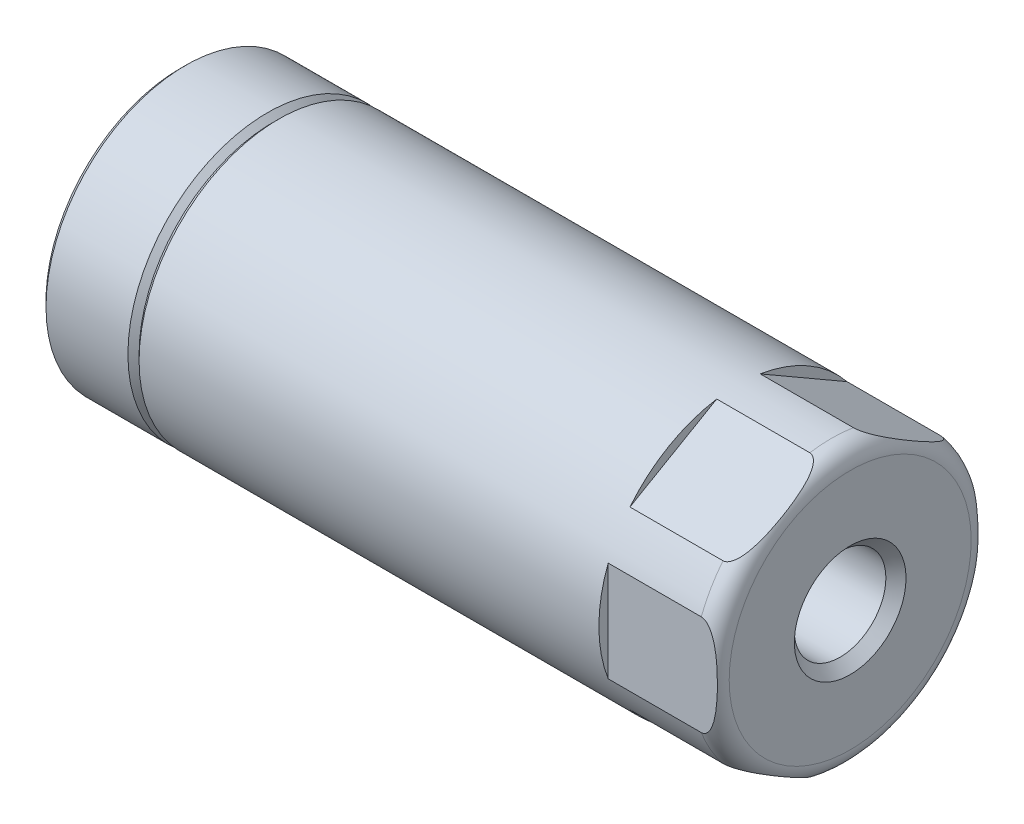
ISO-10303-21;
HEADER;
FILE_DESCRIPTION(('STEP AP214'),'2;1');
FILE_NAME('part.step','',(''),(''),'','','');
FILE_SCHEMA(('AUTOMOTIVE_DESIGN { 1 0 10303 214 1 1 1 1 }'));
ENDSEC;
DATA;
#1=APPLICATION_CONTEXT('core data for automotive mechanical design processes');
#2=APPLICATION_PROTOCOL_DEFINITION('international standard','automotive_design',2000,#1);
#3=PRODUCT_CONTEXT('',#1,'mechanical');
#4=PRODUCT('Part','Part','',(#3));
#5=PRODUCT_RELATED_PRODUCT_CATEGORY('part','',(#4));
#6=PRODUCT_DEFINITION_FORMATION('','',#4);
#7=PRODUCT_DEFINITION_CONTEXT('part definition',#1,'design');
#8=PRODUCT_DEFINITION('design','',#6,#7);
#9=PRODUCT_DEFINITION_SHAPE('','',#8);
#10=(LENGTH_UNIT() NAMED_UNIT(*) SI_UNIT(.MILLI.,.METRE.));
#11=(NAMED_UNIT(*) PLANE_ANGLE_UNIT() SI_UNIT($,.RADIAN.));
#12=(NAMED_UNIT(*) SI_UNIT($,.STERADIAN.) SOLID_ANGLE_UNIT());
#13=UNCERTAINTY_MEASURE_WITH_UNIT(LENGTH_MEASURE(1.E-05),#10,'distance_accuracy_value','');
#14=(GEOMETRIC_REPRESENTATION_CONTEXT(3) GLOBAL_UNCERTAINTY_ASSIGNED_CONTEXT((#13)) GLOBAL_UNIT_ASSIGNED_CONTEXT((#10,
#11,#12)) REPRESENTATION_CONTEXT('',''));
#15=CARTESIAN_POINT('',(0.,0.,0.));
#16=DIRECTION('',(0.,0.,1.));
#17=DIRECTION('',(1.,0.,0.));
#18=AXIS2_PLACEMENT_3D('',#15,#16,#17);
#19=CARTESIAN_POINT('',(210.,0.,0.));
#20=DIRECTION('',(-1.,0.,0.));
#21=DIRECTION('',(0.,0.,1.));
#22=AXIS2_PLACEMENT_3D('',#19,#20,#21);
#23=CYLINDRICAL_SURFACE('',#22,4.25);
#24=CARTESIAN_POINT('',(174.,0.,0.));
#25=DIRECTION('',(-1.,0.,0.));
#26=DIRECTION('',(0.,0.,1.));
#27=AXIS2_PLACEMENT_3D('',#24,#25,#26);
#28=CIRCLE('',#27,4.25);
#29=CARTESIAN_POINT('',(174.,0.,4.25));
#30=VERTEX_POINT('',#29);
#31=EDGE_CURVE('E163',#30,#30,#28,.T.);
#32=ORIENTED_EDGE('',*,*,#31,.T.);
#33=EDGE_LOOP('',(#32));
#34=FACE_BOUND('',#33,.T.);
#35=CARTESIAN_POINT('',(198.199999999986,0.,0.));
#36=DIRECTION('',(-1.,0.,0.));
#37=DIRECTION('',(0.,0.,1.));
#38=AXIS2_PLACEMENT_3D('',#35,#36,#37);
#39=CIRCLE('',#38,4.25000000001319);
#40=CARTESIAN_POINT('',(198.199999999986,0.,4.25000000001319));
#41=VERTEX_POINT('',#40);
#42=EDGE_CURVE('E160',#41,#41,#39,.F.);
#43=ORIENTED_EDGE('',*,*,#42,.T.);
#44=EDGE_LOOP('',(#43));
#45=FACE_BOUND('',#44,.T.);
#46=ADVANCED_FACE('F17',(#34,#45),#23,.F.);
#47=CARTESIAN_POINT('',(174.,0.,0.));
#48=DIRECTION('',(1.,0.,0.));
#49=DIRECTION('',(0.,0.,-1.));
#50=AXIS2_PLACEMENT_3D('',#47,#48,#49);
#51=PLANE('',#50);
#52=ORIENTED_EDGE('',*,*,#31,.F.);
#53=EDGE_LOOP('',(#52));
#54=FACE_BOUND('',#53,.T.);
#55=CARTESIAN_POINT('',(174.,0.,0.));
#56=DIRECTION('',(1.,0.,0.));
#57=DIRECTION('',(0.,0.,-1.));
#58=AXIS2_PLACEMENT_3D('',#55,#56,#57);
#59=CIRCLE('',#58,7.20000000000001);
#60=CARTESIAN_POINT('',(174.,0.,-7.20000000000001));
#61=VERTEX_POINT('',#60);
#62=EDGE_CURVE('E159',#61,#61,#59,.T.);
#63=ORIENTED_EDGE('',*,*,#62,.F.);
#64=EDGE_LOOP('',(#63));
#65=FACE_BOUND('',#64,.T.);
#66=ADVANCED_FACE('F507',(#54,#65),#51,.F.);
#67=CARTESIAN_POINT('',(198.199999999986,0.,0.));
#68=DIRECTION('',(-1.,0.,0.));
#69=DIRECTION('',(0.,0.,1.));
#70=AXIS2_PLACEMENT_3D('',#67,#68,#69);
#71=CONICAL_SURFACE('',#70,4.25000000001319,1.04719755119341);
#72=ORIENTED_EDGE('',*,*,#42,.F.);
#73=EDGE_LOOP('',(#72));
#74=FACE_BOUND('',#73,.T.);
#75=CARTESIAN_POINT('',(199.234323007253,0.,0.));
#76=DIRECTION('',(-1.,0.,0.));
#77=DIRECTION('',(0.,0.,1.));
#78=AXIS2_PLACEMENT_3D('',#75,#76,#77);
#79=CIRCLE('',#78,2.4585);
#80=CARTESIAN_POINT('',(199.234323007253,0.,2.4585));
#81=VERTEX_POINT('',#80);
#82=EDGE_CURVE('E156',#81,#81,#79,.F.);
#83=ORIENTED_EDGE('',*,*,#82,.T.);
#84=EDGE_LOOP('',(#83));
#85=FACE_BOUND('',#84,.T.);
#86=ADVANCED_FACE('F497',(#74,#85),#71,.F.);
#87=CARTESIAN_POINT('',(174.3,0.,0.));
#88=DIRECTION('',(1.,0.,0.));
#89=DIRECTION('',(0.,0.,-1.));
#90=AXIS2_PLACEMENT_3D('',#87,#88,#89);
#91=CONICAL_SURFACE('',#90,7.5,0.785398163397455);
#92=CARTESIAN_POINT('',(174.3,0.,0.));
#93=DIRECTION('',(-1.,0.,0.));
#94=DIRECTION('',(0.,0.,1.));
#95=AXIS2_PLACEMENT_3D('',#92,#93,#94);
#96=CIRCLE('',#95,7.5);
#97=CARTESIAN_POINT('',(174.3,0.,7.5));
#98=VERTEX_POINT('',#97);
#99=EDGE_CURVE('E153',#98,#98,#96,.F.);
#100=ORIENTED_EDGE('',*,*,#99,.F.);
#101=EDGE_LOOP('',(#100));
#102=FACE_BOUND('',#101,.T.);
#103=ORIENTED_EDGE('',*,*,#62,.T.);
#104=EDGE_LOOP('',(#103));
#105=FACE_BOUND('',#104,.T.);
#106=ADVANCED_FACE('F487',(#102,#105),#91,.T.);
#107=CARTESIAN_POINT('',(210.,0.,0.));
#108=DIRECTION('',(-1.,0.,0.));
#109=DIRECTION('',(0.,0.,1.));
#110=AXIS2_PLACEMENT_3D('',#107,#108,#109);
#111=CYLINDRICAL_SURFACE('',#110,2.4585);
#112=ORIENTED_EDGE('',*,*,#82,.F.);
#113=EDGE_LOOP('',(#112));
#114=FACE_BOUND('',#113,.T.);
#115=CARTESIAN_POINT('',(209.458499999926,0.,0.));
#116=DIRECTION('',(1.,0.,0.));
#117=DIRECTION('',(0.,0.,-1.));
#118=AXIS2_PLACEMENT_3D('',#115,#116,#117);
#119=CIRCLE('',#118,2.45849999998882);
#120=CARTESIAN_POINT('',(209.458499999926,0.,-2.45849999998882));
#121=VERTEX_POINT('',#120);
#122=EDGE_CURVE('E150',#121,#121,#119,.T.);
#123=ORIENTED_EDGE('',*,*,#122,.T.);
#124=EDGE_LOOP('',(#123));
#125=FACE_BOUND('',#124,.T.);
#126=ADVANCED_FACE('F476',(#114,#125),#111,.F.);
#127=CARTESIAN_POINT('',(210.,0.,0.));
#128=DIRECTION('',(-1.,0.,0.));
#129=DIRECTION('',(0.,0.,1.));
#130=AXIS2_PLACEMENT_3D('',#127,#128,#129);
#131=CYLINDRICAL_SURFACE('',#130,7.5);
#132=ORIENTED_EDGE('',*,*,#99,.T.);
#133=EDGE_LOOP('',(#132));
#134=FACE_BOUND('',#133,.T.);
#135=CARTESIAN_POINT('',(178.7,0.,0.));
#136=DIRECTION('',(-1.,0.,0.));
#137=DIRECTION('',(0.,0.,1.));
#138=AXIS2_PLACEMENT_3D('',#135,#136,#137);
#139=CIRCLE('',#138,7.5);
#140=CARTESIAN_POINT('',(178.7,0.,7.5));
#141=VERTEX_POINT('',#140);
#142=EDGE_CURVE('E140',#141,#141,#139,.F.);
#143=ORIENTED_EDGE('',*,*,#142,.F.);
#144=EDGE_LOOP('',(#143));
#145=FACE_BOUND('',#144,.T.);
#146=ADVANCED_FACE('F466',(#134,#145),#131,.T.);
#147=CARTESIAN_POINT('',(209.999999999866,0.,0.));
#148=DIRECTION('',(1.,0.,0.));
#149=DIRECTION('',(0.,0.,-1.));
#150=AXIS2_PLACEMENT_3D('',#147,#148,#149);
#151=CONICAL_SURFACE('',#150,2.99999999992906,0.785398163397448);
#152=CARTESIAN_POINT('',(209.999999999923,0.,0.));
#153=DIRECTION('',(1.,0.,0.));
#154=DIRECTION('',(0.,0.,-1.));
#155=AXIS2_PLACEMENT_3D('',#152,#153,#154);
#156=CIRCLE('',#155,2.9999999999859);
#157=CARTESIAN_POINT('',(209.999999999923,0.,-2.9999999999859));
#158=VERTEX_POINT('',#157);
#159=EDGE_CURVE('E130',#158,#158,#156,.T.);
#160=ORIENTED_EDGE('',*,*,#159,.T.);
#161=EDGE_LOOP('',(#160));
#162=FACE_BOUND('',#161,.T.);
#163=ORIENTED_EDGE('',*,*,#122,.F.);
#164=EDGE_LOOP('',(#163));
#165=FACE_BOUND('',#164,.T.);
#166=ADVANCED_FACE('F456',(#162,#165),#151,.F.);
#167=CARTESIAN_POINT('',(178.7,0.,0.));
#168=DIRECTION('',(-1.,0.,0.));
#169=DIRECTION('',(0.,0.,1.));
#170=AXIS2_PLACEMENT_3D('',#167,#168,#169);
#171=CONICAL_SURFACE('',#170,7.5,0.785398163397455);
#172=ORIENTED_EDGE('',*,*,#142,.T.);
#173=EDGE_LOOP('',(#172));
#174=FACE_BOUND('',#173,.T.);
#175=CARTESIAN_POINT('',(179.,0.,0.));
#176=DIRECTION('',(1.,0.,0.));
#177=DIRECTION('',(0.,0.,-1.));
#178=AXIS2_PLACEMENT_3D('',#175,#176,#177);
#179=CIRCLE('',#178,7.2);
#180=CARTESIAN_POINT('',(179.,0.,-7.2));
#181=VERTEX_POINT('',#180);
#182=EDGE_CURVE('E145',#181,#181,#179,.T.);
#183=ORIENTED_EDGE('',*,*,#182,.F.);
#184=EDGE_LOOP('',(#183));
#185=FACE_BOUND('',#184,.T.);
#186=ADVANCED_FACE('F446',(#174,#185),#171,.T.);
#187=CARTESIAN_POINT('',(204.,0.,0.));
#188=DIRECTION('',(1.,0.,0.));
#189=DIRECTION('',(0.,0.,-1.));
#190=AXIS2_PLACEMENT_3D('',#187,#188,#189);
#191=PLANE('',#190);
#192=CARTESIAN_POINT('',(204.,0.,0.));
#193=DIRECTION('',(-1.,0.,0.));
#194=DIRECTION('',(0.,0.,1.));
#195=AXIS2_PLACEMENT_3D('',#192,#193,#194);
#196=CIRCLE('',#195,7.5);
#197=CARTESIAN_POINT('',(204.,-4.71588662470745,-5.8318447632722));
#198=VERTEX_POINT('',#197);
#199=CARTESIAN_POINT('',(204.,-7.4084690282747,-1.16815523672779));
#200=VERTEX_POINT('',#199);
#201=EDGE_CURVE('E138',#198,#200,#196,.T.);
#202=ORIENTED_EDGE('',*,*,#201,.F.);
#203=DIRECTION('',(0.,0.5,-0.866025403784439));
#204=VECTOR('',#203,1.);
#205=CARTESIAN_POINT('',(204.,-8.08290376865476,0.));
#206=LINE('',#205,#204);
#207=EDGE_CURVE('E131',#200,#198,#206,.T.);
#208=ORIENTED_EDGE('',*,*,#207,.F.);
#209=EDGE_LOOP('',(#202,#208));
#210=FACE_BOUND('',#209,.T.);
#211=ADVANCED_FACE('F436',(#210),#191,.T.);
#212=CARTESIAN_POINT('',(204.,-8.08290376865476,0.));
#213=DIRECTION('',(0.,-0.866025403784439,-0.5));
#214=DIRECTION('',(0.,0.5,-0.866025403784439));
#215=AXIS2_PLACEMENT_3D('',#212,#213,#214);
#216=PLANE('',#215);
#217=DIRECTION('',(-1.,0.,0.));
#218=VECTOR('',#217,1.);
#219=CARTESIAN_POINT('',(210.,-4.71588662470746,-5.8318447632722));
#220=LINE('',#219,#218);
#221=CARTESIAN_POINT('',(209.,-4.71588662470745,-5.83184476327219));
#222=VERTEX_POINT('',#221);
#223=EDGE_CURVE('E141',#222,#198,#220,.T.);
#224=ORIENTED_EDGE('',*,*,#223,.F.);
#225=CARTESIAN_POINT('',(209.,-7.40846902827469,-1.16815523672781));
#226=CARTESIAN_POINT('',(209.011200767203,-7.40847068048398,-1.16815237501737));
#227=CARTESIAN_POINT('',(209.022395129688,-7.40820674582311,-1.16860952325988));
#228=CARTESIAN_POINT('',(209.044675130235,-7.40716421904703,-1.17041523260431));
#229=CARTESIAN_POINT('',(209.055760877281,-7.40638621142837,-1.17176278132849));
#230=CARTESIAN_POINT('',(209.088480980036,-7.40332998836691,-1.17705631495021));
#231=CARTESIAN_POINT('',(209.10985577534,-7.40032867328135,-1.18225474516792));
#232=CARTESIAN_POINT('',(209.155857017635,-7.39182550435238,-1.19698266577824));
#233=CARTESIAN_POINT('',(209.180179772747,-7.38592181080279,-1.20720816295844));
#234=CARTESIAN_POINT('',(209.226666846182,-7.37221448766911,-1.23094994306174));
#235=CARTESIAN_POINT('',(209.248820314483,-7.36440192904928,-1.24448169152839));
#236=CARTESIAN_POINT('',(209.30292151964,-7.34254059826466,-1.28234662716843));
#237=CARTESIAN_POINT('',(209.333218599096,-7.32748167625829,-1.30842944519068));
#238=CARTESIAN_POINT('',(209.38904214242,-7.29533035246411,-1.3641171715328));
#239=CARTESIAN_POINT('',(209.41455922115,-7.27823405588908,-1.39372882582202));
#240=CARTESIAN_POINT('',(209.46152941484,-7.24289259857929,-1.4549420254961));
#241=CARTESIAN_POINT('',(209.48300984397,-7.22465636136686,-1.48652811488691));
#242=CARTESIAN_POINT('',(209.522851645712,-7.18734173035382,-1.55115895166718));
#243=CARTESIAN_POINT('',(209.541209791,-7.16826249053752,-1.58420516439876));
#244=CARTESIAN_POINT('',(209.575375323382,-7.12949680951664,-1.65134929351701));
#245=CARTESIAN_POINT('',(209.591176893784,-7.10980910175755,-1.68544940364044));
#246=CARTESIAN_POINT('',(209.620594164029,-7.07004566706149,-1.75432169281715));
#247=CARTESIAN_POINT('',(209.634210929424,-7.049970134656,-1.78909353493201));
#248=CARTESIAN_POINT('',(209.675329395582,-6.98453529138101,-1.90243000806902));
#249=CARTESIAN_POINT('',(209.699183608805,-6.93860314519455,-1.98198681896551));
#250=CARTESIAN_POINT('',(209.740410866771,-6.84595991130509,-2.14244960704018));
#251=CARTESIAN_POINT('',(209.757770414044,-6.7992474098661,-2.22335803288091));
#252=CARTESIAN_POINT('',(209.787604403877,-6.70539133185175,-2.38592152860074));
#253=CARTESIAN_POINT('',(209.800073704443,-6.65824735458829,-2.46757729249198));
#254=CARTESIAN_POINT('',(209.821278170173,-6.56348745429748,-2.63170625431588));
#255=CARTESIAN_POINT('',(209.829991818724,-6.51587037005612,-2.71418146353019));
#256=CARTESIAN_POINT('',(209.844338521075,-6.42058538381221,-2.87921990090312));
#257=CARTESIAN_POINT('',(209.849975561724,-6.37291762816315,-2.96178287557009));
#258=CARTESIAN_POINT('',(209.858670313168,-6.27754207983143,-3.12697817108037));
#259=CARTESIAN_POINT('',(209.861728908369,-6.22983430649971,-3.20961045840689));
#260=CARTESIAN_POINT('',(209.86649177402,-6.11091781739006,-3.41557985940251));
#261=CARTESIAN_POINT('',(209.866789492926,-6.03969415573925,-3.53894286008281));
#262=CARTESIAN_POINT('',(209.862355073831,-5.89724505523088,-3.78567193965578));
#263=CARTESIAN_POINT('',(209.857619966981,-5.82601964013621,-3.90903797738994));
#264=CARTESIAN_POINT('',(209.842243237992,-5.68414906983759,-4.15476501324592));
#265=CARTESIAN_POINT('',(209.831638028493,-5.61350303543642,-4.277127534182));
#266=CARTESIAN_POINT('',(209.809751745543,-5.5078668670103,-4.46009474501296));
#267=CARTESIAN_POINT('',(209.801463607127,-5.47272177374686,-4.52096783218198));
#268=CARTESIAN_POINT('',(209.782472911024,-5.40259597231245,-4.64242928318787));
#269=CARTESIAN_POINT('',(209.771770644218,-5.36761524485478,-4.70301768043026));
#270=CARTESIAN_POINT('',(209.746614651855,-5.29561289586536,-4.82772940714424));
#271=CARTESIAN_POINT('',(209.731960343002,-5.25860851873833,-4.89182286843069));
#272=CARTESIAN_POINT('',(209.698358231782,-5.18495954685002,-5.01938662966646));
#273=CARTESIAN_POINT('',(209.679398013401,-5.14831631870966,-5.08285456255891));
#274=CARTESIAN_POINT('',(209.645016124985,-5.09103788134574,-5.18206372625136));
#275=CARTESIAN_POINT('',(209.631438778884,-5.07012641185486,-5.21828345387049));
#276=CARTESIAN_POINT('',(209.60204878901,-5.02870248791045,-5.29003179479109));
#277=CARTESIAN_POINT('',(209.586236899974,-5.00818990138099,-5.32556063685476));
#278=CARTESIAN_POINT('',(209.552001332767,-4.96781298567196,-5.39549550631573));
#279=CARTESIAN_POINT('',(209.533588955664,-4.94794628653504,-5.42990563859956));
#280=CARTESIAN_POINT('',(209.493517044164,-4.90902856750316,-5.49731310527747));
#281=CARTESIAN_POINT('',(209.47185725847,-4.88997761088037,-5.53031033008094));
#282=CARTESIAN_POINT('',(209.430202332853,-4.85755467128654,-5.58646850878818));
#283=CARTESIAN_POINT('',(209.411049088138,-4.84391461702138,-5.61009377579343));
#284=CARTESIAN_POINT('',(209.370040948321,-4.81770589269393,-5.65548861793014));
#285=CARTESIAN_POINT('',(209.348190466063,-4.80513552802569,-5.6772611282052));
#286=CARTESIAN_POINT('',(209.301015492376,-4.78136907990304,-5.71842582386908));
#287=CARTESIAN_POINT('',(209.275647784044,-4.7701940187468,-5.73778159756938));
#288=CARTESIAN_POINT('',(209.221370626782,-4.7502362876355,-5.77234940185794));
#289=CARTESIAN_POINT('',(209.19247291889,-4.74144598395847,-5.78757465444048));
#290=CARTESIAN_POINT('',(209.142228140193,-4.72981901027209,-5.80771316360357));
#291=CARTESIAN_POINT('',(209.121814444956,-4.72597601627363,-5.81436942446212));
#292=CARTESIAN_POINT('',(209.080005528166,-4.72004816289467,-5.8246367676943));
#293=CARTESIAN_POINT('',(209.0586131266,-4.71795855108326,-5.82825608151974));
#294=CARTESIAN_POINT('',(209.030893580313,-4.71652468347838,-5.83073961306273));
#295=CARTESIAN_POINT('',(209.024723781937,-4.71628564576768,-5.83115363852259));
#296=CARTESIAN_POINT('',(209.012370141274,-4.71596676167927,-5.83170596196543));
#297=CARTESIAN_POINT('',(209.006186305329,-4.71588685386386,-5.83184436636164));
#298=CARTESIAN_POINT('',(209.,-4.71588662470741,-5.83184476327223));
#299=B_SPLINE_CURVE_WITH_KNOTS('',3,(#225,#226,#227,#228,#229,#230,#231,#232,#233,#234,#235,
#236,#237,#238,#239,#240,#241,#242,#243,#244,#245,#246,#247,#248,#249,#250,#251,#252,#253,#254,
#255,#256,#257,#258,#259,#260,#261,#262,#263,#264,#265,#266,#267,#268,#269,#270,#271,#272,#273,
#274,#275,#276,#277,#278,#279,#280,#281,#282,#283,#284,#285,#286,#287,#288,#289,#290,#291,#292,
#293,#294,#295,#296,#297,#298),.UNSPECIFIED.,.F.,.F.,(4,2,2,2,2,2,2,2,2,2,2,2,2,2,2,2,2,2,2,2,2,
2,2,2,2,2,2,2,2,2,2,2,2,2,2,2,4),(0.,0.0335780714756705,0.0671180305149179,0.133377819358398,
0.214046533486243,0.295100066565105,0.42254080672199,0.550229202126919,0.677019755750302,
0.8039405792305,0.931146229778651,1.0582896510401,1.34262726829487,1.627552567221,
1.9127766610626,2.19961379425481,2.48607833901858,2.77244458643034,3.19969305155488,
3.62719368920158,4.05207175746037,4.26437145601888,4.47664558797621,4.70289408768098,
4.92980344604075,5.06166900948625,5.19349014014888,5.32475509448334,5.45603021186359,
5.55589257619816,5.65559367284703,5.75665111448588,5.85738114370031,5.92257044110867,
5.98758247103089,6.00614159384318,6.02469354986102),.UNSPECIFIED.);
#300=CARTESIAN_POINT('',(209.,-7.40846902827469,-1.1681552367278));
#301=VERTEX_POINT('',#300);
#302=EDGE_CURVE('E106',#301,#222,#299,.T.);
#303=ORIENTED_EDGE('',*,*,#302,.F.);
#304=DIRECTION('',(-1.,0.,0.));
#305=VECTOR('',#304,1.);
#306=CARTESIAN_POINT('',(210.,-7.4084690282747,-1.16815523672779));
#307=LINE('',#306,#305);
#308=EDGE_CURVE('E135',#200,#301,#307,.F.);
#309=ORIENTED_EDGE('',*,*,#308,.F.);
#310=ORIENTED_EDGE('',*,*,#207,.T.);
#311=EDGE_LOOP('',(#224,#303,#309,#310));
#312=FACE_BOUND('',#311,.T.);
#313=ADVANCED_FACE('F426',(#312),#216,.T.);
#314=CARTESIAN_POINT('',(204.,0.,0.));
#315=DIRECTION('',(1.,0.,0.));
#316=DIRECTION('',(0.,0.,-1.));
#317=AXIS2_PLACEMENT_3D('',#314,#315,#316);
#318=PLANE('',#317);
#319=CARTESIAN_POINT('',(204.,0.,0.));
#320=DIRECTION('',(-1.,0.,0.));
#321=DIRECTION('',(0.,0.,1.));
#322=AXIS2_PLACEMENT_3D('',#319,#320,#321);
#323=CIRCLE('',#322,7.5);
#324=CARTESIAN_POINT('',(204.,-7.40846902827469,1.1681552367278));
#325=VERTEX_POINT('',#324);
#326=CARTESIAN_POINT('',(204.,-4.71588662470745,5.8318447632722));
#327=VERTEX_POINT('',#326);
#328=EDGE_CURVE('E123',#325,#327,#323,.T.);
#329=ORIENTED_EDGE('',*,*,#328,.F.);
#330=DIRECTION('',(0.,-0.5,-0.866025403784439));
#331=VECTOR('',#330,1.);
#332=CARTESIAN_POINT('',(204.,-4.04145188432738,7.));
#333=LINE('',#332,#331);
#334=EDGE_CURVE('E128',#327,#325,#333,.T.);
#335=ORIENTED_EDGE('',*,*,#334,.F.);
#336=EDGE_LOOP('',(#329,#335));
#337=FACE_BOUND('',#336,.T.);
#338=ADVANCED_FACE('F418',(#337),#318,.T.);
#339=CARTESIAN_POINT('',(204.,-4.04145188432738,7.));
#340=DIRECTION('',(0.,-0.866025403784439,0.5));
#341=DIRECTION('',(0.,-0.5,-0.866025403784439));
#342=AXIS2_PLACEMENT_3D('',#339,#340,#341);
#343=PLANE('',#342);
#344=DIRECTION('',(-1.,0.,0.));
#345=VECTOR('',#344,1.);
#346=CARTESIAN_POINT('',(210.,-7.40846902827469,1.16815523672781));
#347=LINE('',#346,#345);
#348=CARTESIAN_POINT('',(209.,-7.40846902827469,1.16815523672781));
#349=VERTEX_POINT('',#348);
#350=EDGE_CURVE('E103',#349,#325,#347,.T.);
#351=ORIENTED_EDGE('',*,*,#350,.F.);
#352=CARTESIAN_POINT('',(209.,-4.71588662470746,5.83184476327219));
#353=CARTESIAN_POINT('',(209.011200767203,-4.71588497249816,5.83184762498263));
#354=CARTESIAN_POINT('',(209.022395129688,-4.71614890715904,5.83139047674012));
#355=CARTESIAN_POINT('',(209.044675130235,-4.71719143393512,5.82958476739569));
#356=CARTESIAN_POINT('',(209.055760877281,-4.71796944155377,5.82823721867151));
#357=CARTESIAN_POINT('',(209.088480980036,-4.72102566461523,5.82294368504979));
#358=CARTESIAN_POINT('',(209.10985577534,-4.72402697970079,5.81774525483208));
#359=CARTESIAN_POINT('',(209.155857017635,-4.73253014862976,5.80301733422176));
#360=CARTESIAN_POINT('',(209.180179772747,-4.73843384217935,5.79279183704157));
#361=CARTESIAN_POINT('',(209.226666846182,-4.75214116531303,5.76905005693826));
#362=CARTESIAN_POINT('',(209.248820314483,-4.75995372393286,5.75551830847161));
#363=CARTESIAN_POINT('',(209.30292151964,-4.78181505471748,5.71765337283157));
#364=CARTESIAN_POINT('',(209.333218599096,-4.79687397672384,5.69157055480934));
#365=CARTESIAN_POINT('',(209.38904214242,-4.82902530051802,5.63588282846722));
#366=CARTESIAN_POINT('',(209.41455922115,-4.84612159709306,5.606271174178));
#367=CARTESIAN_POINT('',(209.46152941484,-4.88146305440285,5.54505797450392));
#368=CARTESIAN_POINT('',(209.48300984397,-4.89969929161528,5.51347188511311));
#369=CARTESIAN_POINT('',(209.522851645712,-4.93701392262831,5.44884104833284));
#370=CARTESIAN_POINT('',(209.541209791,-4.95609316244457,5.41579483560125));
#371=CARTESIAN_POINT('',(209.575375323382,-4.99485884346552,5.34865070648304));
#372=CARTESIAN_POINT('',(209.591176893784,-5.01454655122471,5.31455059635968));
#373=CARTESIAN_POINT('',(209.620594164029,-5.05430998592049,5.24567830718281));
#374=CARTESIAN_POINT('',(209.634210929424,-5.07438551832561,5.21090646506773));
#375=CARTESIAN_POINT('',(209.675329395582,-5.13982036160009,5.09756999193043));
#376=CARTESIAN_POINT('',(209.699183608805,-5.18575250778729,5.01801318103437));
#377=CARTESIAN_POINT('',(209.740410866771,-5.2783957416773,4.85755039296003));
#378=CARTESIAN_POINT('',(209.757770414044,-5.32510824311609,4.77664196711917));
#379=CARTESIAN_POINT('',(209.787604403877,-5.41896432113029,4.61407847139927));
#380=CARTESIAN_POINT('',(209.800073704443,-5.4661082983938,4.53242270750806));
#381=CARTESIAN_POINT('',(209.821278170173,-5.56086819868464,4.3682937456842));
#382=CARTESIAN_POINT('',(209.829991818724,-5.60848528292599,4.28581853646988));
#383=CARTESIAN_POINT('',(209.844338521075,-5.70377026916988,4.12078009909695));
#384=CARTESIAN_POINT('',(209.849975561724,-5.75143802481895,4.03821712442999));
#385=CARTESIAN_POINT('',(209.858670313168,-5.84681357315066,3.87302182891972));
#386=CARTESIAN_POINT('',(209.861728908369,-5.89452134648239,3.7903895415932));
#387=CARTESIAN_POINT('',(209.86649177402,-6.01343783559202,3.58442014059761));
#388=CARTESIAN_POINT('',(209.866789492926,-6.08466149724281,3.46105713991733));
#389=CARTESIAN_POINT('',(209.862355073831,-6.22711059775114,3.21432806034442));
#390=CARTESIAN_POINT('',(209.857619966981,-6.2983360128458,3.09096202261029));
#391=CARTESIAN_POINT('',(209.842243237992,-6.44020658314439,2.84523498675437));
#392=CARTESIAN_POINT('',(209.831638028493,-6.51085261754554,2.72287246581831));
#393=CARTESIAN_POINT('',(209.809751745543,-6.61648878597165,2.53990525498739));
#394=CARTESIAN_POINT('',(209.801463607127,-6.65163387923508,2.47903216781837));
#395=CARTESIAN_POINT('',(209.782472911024,-6.72175968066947,2.35757071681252));
#396=CARTESIAN_POINT('',(209.771770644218,-6.75674040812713,2.29698231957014));
#397=CARTESIAN_POINT('',(209.746614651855,-6.82874275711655,2.17227059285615));
#398=CARTESIAN_POINT('',(209.731960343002,-6.8657471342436,2.10817713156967));
#399=CARTESIAN_POINT('',(209.698358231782,-6.93939610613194,1.98061337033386));
#400=CARTESIAN_POINT('',(209.679398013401,-6.97603933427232,1.91714543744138));
#401=CARTESIAN_POINT('',(209.645016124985,-7.03331777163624,1.81793627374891));
#402=CARTESIAN_POINT('',(209.631438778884,-7.05422924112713,1.78171654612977));
#403=CARTESIAN_POINT('',(209.60204878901,-7.09565316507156,1.70996820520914));
#404=CARTESIAN_POINT('',(209.586236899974,-7.11616575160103,1.67443936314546));
#405=CARTESIAN_POINT('',(209.552001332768,-7.15654266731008,1.60450449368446));
#406=CARTESIAN_POINT('',(209.533588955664,-7.17640936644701,1.57009436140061));
#407=CARTESIAN_POINT('',(209.493517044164,-7.2153270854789,1.50268689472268));
#408=CARTESIAN_POINT('',(209.47185725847,-7.2343780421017,1.4696896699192));
#409=CARTESIAN_POINT('',(209.430202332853,-7.26680098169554,1.41353149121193));
#410=CARTESIAN_POINT('',(209.411049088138,-7.2804410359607,1.38990622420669));
#411=CARTESIAN_POINT('',(209.370040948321,-7.30664976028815,1.34451138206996));
#412=CARTESIAN_POINT('',(209.348190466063,-7.3192201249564,1.32273887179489));
#413=CARTESIAN_POINT('',(209.301015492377,-7.34298657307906,1.281574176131));
#414=CARTESIAN_POINT('',(209.275647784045,-7.35416163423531,1.26221840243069));
#415=CARTESIAN_POINT('',(209.221370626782,-7.3741193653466,1.22765059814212));
#416=CARTESIAN_POINT('',(209.19247291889,-7.38290966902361,1.21242534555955));
#417=CARTESIAN_POINT('',(209.142228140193,-7.39453664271,1.19228683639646));
#418=CARTESIAN_POINT('',(209.121814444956,-7.39837963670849,1.18563057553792));
#419=CARTESIAN_POINT('',(209.080005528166,-7.40430749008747,1.17536323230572));
#420=CARTESIAN_POINT('',(209.0586131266,-7.40639710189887,1.17174391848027));
#421=CARTESIAN_POINT('',(209.030893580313,-7.40783096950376,1.16926038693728));
#422=CARTESIAN_POINT('',(209.024723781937,-7.40807000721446,1.16884636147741));
#423=CARTESIAN_POINT('',(209.012370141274,-7.40838889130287,1.16829403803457));
#424=CARTESIAN_POINT('',(209.006186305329,-7.40846879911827,1.16815563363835));
#425=CARTESIAN_POINT('',(209.,-7.4084690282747,1.16815523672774));
#426=B_SPLINE_CURVE_WITH_KNOTS('',3,(#352,#353,#354,#355,#356,#357,#358,#359,#360,#361,#362,
#363,#364,#365,#366,#367,#368,#369,#370,#371,#372,#373,#374,#375,#376,#377,#378,#379,#380,#381,
#382,#383,#384,#385,#386,#387,#388,#389,#390,#391,#392,#393,#394,#395,#396,#397,#398,#399,#400,
#401,#402,#403,#404,#405,#406,#407,#408,#409,#410,#411,#412,#413,#414,#415,#416,#417,#418,#419,
#420,#421,#422,#423,#424,#425),.UNSPECIFIED.,.F.,.F.,(4,2,2,2,2,2,2,2,2,2,2,2,2,2,2,2,2,2,2,2,2,
2,2,2,2,2,2,2,2,2,2,2,2,2,2,2,4),(0.,0.0335780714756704,0.0671180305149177,0.133377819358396,
0.214046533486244,0.295100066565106,0.422540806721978,0.55022920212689,0.677019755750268,
0.803940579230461,0.931146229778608,1.05828965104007,1.34262726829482,1.62755256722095,
1.91277666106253,2.19961379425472,2.48607833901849,2.77244458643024,3.19969305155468,
3.62719368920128,4.05207175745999,4.26437145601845,4.47664558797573,4.70289408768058,
4.92980344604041,5.06166900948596,5.19349014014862,5.32475509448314,5.45603021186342,
5.55589257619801,5.65559367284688,5.75665111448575,5.85738114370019,5.92257044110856,
5.98758247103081,6.00614159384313,6.024693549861),.UNSPECIFIED.);
#427=CARTESIAN_POINT('',(209.,-4.71588662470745,5.8318447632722));
#428=VERTEX_POINT('',#427);
#429=EDGE_CURVE('E96',#428,#349,#426,.T.);
#430=ORIENTED_EDGE('',*,*,#429,.F.);
#431=DIRECTION('',(-1.,0.,0.));
#432=VECTOR('',#431,1.);
#433=CARTESIAN_POINT('',(210.,-4.71588662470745,5.8318447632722));
#434=LINE('',#433,#432);
#435=EDGE_CURVE('E100',#327,#428,#434,.F.);
#436=ORIENTED_EDGE('',*,*,#435,.F.);
#437=ORIENTED_EDGE('',*,*,#334,.T.);
#438=EDGE_LOOP('',(#351,#430,#436,#437));
#439=FACE_BOUND('',#438,.T.);
#440=ADVANCED_FACE('F98',(#439),#343,.T.);
#441=CARTESIAN_POINT('',(210.,6.5,0.));
#442=DIRECTION('',(-1.,0.,0.));
#443=DIRECTION('',(0.,0.,1.));
#444=AXIS2_PLACEMENT_3D('',#441,#442,#443);
#445=PLANE('',#444);
#446=ORIENTED_EDGE('',*,*,#159,.F.);
#447=EDGE_LOOP('',(#446));
#448=FACE_BOUND('',#447,.T.);
#449=CARTESIAN_POINT('',(210.,0.,0.));
#450=DIRECTION('',(-1.,0.,0.));
#451=DIRECTION('',(0.,0.,-1.));
#452=AXIS2_PLACEMENT_3D('',#449,#450,#451);
#453=CIRCLE('',#452,6.5);
#454=CARTESIAN_POINT('',(210.,0.,-6.50000000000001));
#455=VERTEX_POINT('',#454);
#456=CARTESIAN_POINT('',(210.,0.,6.50000000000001));
#457=VERTEX_POINT('',#456);
#458=EDGE_CURVE('E107',#455,#457,#453,.T.);
#459=ORIENTED_EDGE('',*,*,#458,.F.);
#460=CARTESIAN_POINT('',(210.,0.,0.));
#461=DIRECTION('',(-1.,0.,0.));
#462=DIRECTION('',(0.,0.,1.));
#463=AXIS2_PLACEMENT_3D('',#460,#461,#462);
#464=CIRCLE('',#463,6.5);
#465=EDGE_CURVE('E229',#457,#455,#464,.T.);
#466=ORIENTED_EDGE('',*,*,#465,.F.);
#467=EDGE_LOOP('',(#459,#466));
#468=FACE_BOUND('',#467,.T.);
#469=ADVANCED_FACE('F202',(#448,#468),#445,.F.);
#470=CARTESIAN_POINT('',(204.,0.,0.));
#471=DIRECTION('',(1.,0.,0.));
#472=DIRECTION('',(0.,0.,-1.));
#473=AXIS2_PLACEMENT_3D('',#470,#471,#472);
#474=PLANE('',#473);
#475=CARTESIAN_POINT('',(204.,0.,0.));
#476=DIRECTION('',(-1.,0.,0.));
#477=DIRECTION('',(0.,0.,1.));
#478=AXIS2_PLACEMENT_3D('',#475,#476,#477);
#479=CIRCLE('',#478,7.5);
#480=CARTESIAN_POINT('',(204.,2.69258240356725,-7.));
#481=VERTEX_POINT('',#480);
#482=CARTESIAN_POINT('',(204.,-2.69258240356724,-7.));
#483=VERTEX_POINT('',#482);
#484=EDGE_CURVE('E179',#481,#483,#479,.T.);
#485=ORIENTED_EDGE('',*,*,#484,.F.);
#486=DIRECTION('',(0.,1.,0.));
#487=VECTOR('',#486,1.);
#488=CARTESIAN_POINT('',(204.,-4.04145188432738,-7.));
#489=LINE('',#488,#487);
#490=EDGE_CURVE('E187',#483,#481,#489,.T.);
#491=ORIENTED_EDGE('',*,*,#490,.F.);
#492=EDGE_LOOP('',(#485,#491));
#493=FACE_BOUND('',#492,.T.);
#494=ADVANCED_FACE('F200',(#493),#474,.T.);
#495=CARTESIAN_POINT('',(179.3,0.,0.));
#496=DIRECTION('',(1.,0.,0.));
#497=DIRECTION('',(0.,0.,-1.));
#498=AXIS2_PLACEMENT_3D('',#495,#496,#497);
#499=CONICAL_SURFACE('',#498,7.5,0.785398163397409);
#500=CARTESIAN_POINT('',(179.3,0.,0.));
#501=DIRECTION('',(-1.,0.,0.));
#502=DIRECTION('',(0.,0.,1.));
#503=AXIS2_PLACEMENT_3D('',#500,#501,#502);
#504=CIRCLE('',#503,7.5);
#505=CARTESIAN_POINT('',(179.3,0.,7.5));
#506=VERTEX_POINT('',#505);
#507=EDGE_CURVE('E178',#506,#506,#504,.F.);
#508=ORIENTED_EDGE('',*,*,#507,.F.);
#509=EDGE_LOOP('',(#508));
#510=FACE_BOUND('',#509,.T.);
#511=ORIENTED_EDGE('',*,*,#182,.T.);
#512=EDGE_LOOP('',(#511));
#513=FACE_BOUND('',#512,.T.);
#514=ADVANCED_FACE('F337',(#510,#513),#499,.T.);
#515=CARTESIAN_POINT('',(204.,0.,0.));
#516=DIRECTION('',(1.,0.,0.));
#517=DIRECTION('',(0.,0.,-1.));
#518=AXIS2_PLACEMENT_3D('',#515,#516,#517);
#519=PLANE('',#518);
#520=CARTESIAN_POINT('',(204.,0.,0.));
#521=DIRECTION('',(-1.,0.,0.));
#522=DIRECTION('',(0.,0.,1.));
#523=AXIS2_PLACEMENT_3D('',#520,#521,#522);
#524=CIRCLE('',#523,7.5);
#525=CARTESIAN_POINT('',(204.,-2.69258240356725,7.));
#526=VERTEX_POINT('',#525);
#527=CARTESIAN_POINT('',(204.,2.69258240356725,7.));
#528=VERTEX_POINT('',#527);
#529=EDGE_CURVE('E174',#526,#528,#524,.T.);
#530=ORIENTED_EDGE('',*,*,#529,.F.);
#531=DIRECTION('',(0.,1.,0.));
#532=VECTOR('',#531,1.);
#533=CARTESIAN_POINT('',(204.,4.04145188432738,7.));
#534=LINE('',#533,#532);
#535=EDGE_CURVE('E118',#528,#526,#534,.F.);
#536=ORIENTED_EDGE('',*,*,#535,.F.);
#537=EDGE_LOOP('',(#530,#536));
#538=FACE_BOUND('',#537,.T.);
#539=ADVANCED_FACE('F286',(#538),#519,.T.);
#540=CARTESIAN_POINT('',(204.,4.04145188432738,7.));
#541=DIRECTION('',(0.,0.,1.));
#542=DIRECTION('',(1.,0.,0.));
#543=AXIS2_PLACEMENT_3D('',#540,#541,#542);
#544=PLANE('',#543);
#545=DIRECTION('',(1.,0.,0.));
#546=VECTOR('',#545,1.);
#547=CARTESIAN_POINT('',(204.,-2.69258240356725,7.));
#548=LINE('',#547,#546);
#549=CARTESIAN_POINT('',(209.,-2.69258240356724,7.));
#550=VERTEX_POINT('',#549);
#551=EDGE_CURVE('E272',#526,#550,#548,.T.);
#552=ORIENTED_EDGE('',*,*,#551,.T.);
#553=CARTESIAN_POINT('',(209.,2.69258240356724,7.));
#554=CARTESIAN_POINT('',(209.011200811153,2.69258570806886,7.));
#555=CARTESIAN_POINT('',(209.022395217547,2.69205783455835,7.));
#556=CARTESIAN_POINT('',(209.044675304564,2.68997276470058,7.));
#557=CARTESIAN_POINT('',(209.055761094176,2.68841673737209,7.));
#558=CARTESIAN_POINT('',(209.088481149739,2.68230427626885,7.));
#559=CARTESIAN_POINT('',(209.109855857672,2.67630166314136,7.));
#560=CARTESIAN_POINT('',(209.155856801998,2.65929543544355,7.));
#561=CARTESIAN_POINT('',(209.18017935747,2.64748817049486,7.));
#562=CARTESIAN_POINT('',(209.226666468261,2.62007358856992,7.));
#563=CARTESIAN_POINT('',(209.24882013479,2.60444834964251,7.));
#564=CARTESIAN_POINT('',(209.302922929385,2.56072440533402,7.));
#565=CARTESIAN_POINT('',(209.333221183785,2.5306051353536,7.));
#566=CARTESIAN_POINT('',(209.389044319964,2.46630212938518,7.));
#567=CARTESIAN_POINT('',(209.414560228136,2.43211094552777,7.));
#568=CARTESIAN_POINT('',(209.461523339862,2.3614386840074,7.));
#569=CARTESIAN_POINT('',(209.482998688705,2.32497599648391,7.00000000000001));
#570=CARTESIAN_POINT('',(209.522831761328,2.25036702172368,6.99999999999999));
#571=CARTESIAN_POINT('',(209.541186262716,2.21221904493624,6.99999999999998));
#572=CARTESIAN_POINT('',(209.57535447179,2.1346889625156,7.00000000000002));
#573=CARTESIAN_POINT('',(209.591161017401,2.09530373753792,7.00000000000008));
#574=CARTESIAN_POINT('',(209.620587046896,2.01575664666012,6.99999999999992));
#575=CARTESIAN_POINT('',(209.634207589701,1.97559516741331,6.9999999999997));
#576=CARTESIAN_POINT('',(209.675389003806,1.84452538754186,6.99999999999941));
#577=CARTESIAN_POINT('',(209.699283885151,1.75246560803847,6.99999999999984));
#578=CARTESIAN_POINT('',(209.740569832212,1.56678396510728,7.00000000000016));
#579=CARTESIAN_POINT('',(209.757947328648,1.47315926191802,7.00000000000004));
#580=CARTESIAN_POINT('',(209.787801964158,1.28504904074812,6.99999999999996));
#581=CARTESIAN_POINT('',(209.800274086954,1.19056274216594,6.99999999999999));
#582=CARTESIAN_POINT('',(209.821429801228,1.00104531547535,7.00000000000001));
#583=CARTESIAN_POINT('',(209.830107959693,0.906013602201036,7.));
#584=CARTESIAN_POINT('',(209.844398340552,0.715847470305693,7.));
#585=CARTESIAN_POINT('',(209.850014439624,0.62071333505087,7.));
#586=CARTESIAN_POINT('',(209.858683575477,0.430350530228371,7.));
#587=CARTESIAN_POINT('',(209.861737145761,0.335121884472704,7.));
#588=CARTESIAN_POINT('',(209.864438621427,0.199911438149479,7.));
#589=CARTESIAN_POINT('',(209.865034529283,0.15994628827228,7.));
#590=CARTESIAN_POINT('',(209.865827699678,0.0799876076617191,7.));
#591=CARTESIAN_POINT('',(209.866024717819,0.0399940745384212,7.));
#592=CARTESIAN_POINT('',(209.866027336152,-0.112663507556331,7.));
#593=CARTESIAN_POINT('',(209.864471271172,-0.22533131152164,7.));
#594=CARTESIAN_POINT('',(209.858061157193,-0.450605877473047,7.));
#595=CARTESIAN_POINT('',(209.853206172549,-0.563212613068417,7.));
#596=CARTESIAN_POINT('',(209.839592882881,-0.788434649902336,7.));
#597=CARTESIAN_POINT('',(209.830826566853,-0.901049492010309,6.99999999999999));
#598=CARTESIAN_POINT('',(209.808389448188,-1.12504429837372,7.00000000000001));
#599=CARTESIAN_POINT('',(209.794751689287,-1.23642749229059,7.00000000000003));
#600=CARTESIAN_POINT('',(209.760916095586,-1.45807302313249,6.99999999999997));
#601=CARTESIAN_POINT('',(209.74072927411,-1.56833692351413,6.99999999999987));
#602=CARTESIAN_POINT('',(209.703515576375,-1.73200129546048,7.00000000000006));
#603=CARTESIAN_POINT('',(209.68997877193,-1.78619422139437,7.00000000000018));
#604=CARTESIAN_POINT('',(209.660086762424,-1.89379029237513,6.99999999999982));
#605=CARTESIAN_POINT('',(209.643732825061,-1.94719378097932,6.99999999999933));
#606=CARTESIAN_POINT('',(209.617514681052,-2.0237254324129,6.99999999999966));
#607=CARTESIAN_POINT('',(209.60903633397,-2.04733029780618,6.99999999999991));
#608=CARTESIAN_POINT('',(209.591298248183,-2.09424803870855,7.00000000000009));
#609=CARTESIAN_POINT('',(209.58203838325,-2.11756086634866,7.00000000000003));
#610=CARTESIAN_POINT('',(209.552933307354,-2.18703269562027,6.99999999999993));
#611=CARTESIAN_POINT('',(209.531783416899,-2.23266273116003,6.99999999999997));
#612=CARTESIAN_POINT('',(209.484978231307,-2.32201388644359,7.00000000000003));
#613=CARTESIAN_POINT('',(209.459290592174,-2.36571828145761,7.00000000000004));
#614=CARTESIAN_POINT('',(209.402322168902,-2.44933428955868,6.99999999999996));
#615=CARTESIAN_POINT('',(209.37105723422,-2.48925617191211,6.99999999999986));
#616=CARTESIAN_POINT('',(209.317595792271,-2.54548103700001,6.99999999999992));
#617=CARTESIAN_POINT('',(209.297910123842,-2.56415666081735,6.99999999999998));
#618=CARTESIAN_POINT('',(209.256268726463,-2.59886384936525,7.00000000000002));
#619=CARTESIAN_POINT('',(209.234311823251,-2.61489403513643,7.00000000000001));
#620=CARTESIAN_POINT('',(209.187763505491,-2.64349979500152,6.99999999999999));
#621=CARTESIAN_POINT('',(209.163138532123,-2.65602195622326,7.));
#622=CARTESIAN_POINT('',(209.111932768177,-2.67597305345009,7.));
#623=CARTESIAN_POINT('',(209.085360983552,-2.68342398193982,7.));
#624=CARTESIAN_POINT('',(209.048699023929,-2.68940819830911,7.));
#625=CARTESIAN_POINT('',(209.039004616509,-2.69059467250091,7.));
#626=CARTESIAN_POINT('',(209.019542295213,-2.69218222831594,7.));
#627=CARTESIAN_POINT('',(209.009774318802,-2.69258254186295,7.));
#628=CARTESIAN_POINT('',(209.,-2.69258240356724,7.));
#629=B_SPLINE_CURVE_WITH_KNOTS('',3,(#553,#554,#555,#556,#557,#558,#559,#560,#561,#562,#563,
#564,#565,#566,#567,#568,#569,#570,#571,#572,#573,#574,#575,#576,#577,#578,#579,#580,#581,#582,
#583,#584,#585,#586,#587,#588,#589,#590,#591,#592,#593,#594,#595,#596,#597,#598,#599,#600,#601,
#602,#603,#604,#605,#606,#607,#608,#609,#610,#611,#612,#613,#614,#615,#616,#617,#618,#619,#620,
#621,#622,#623,#624,#625,#626,#627,#628),.UNSPECIFIED.,.F.,.F.,(4,2,2,2,2,2,2,2,2,2,2,2,2,2,2,2,
2,2,2,2,2,2,2,2,2,2,2,2,2,2,2,2,2,2,2,2,2,4),(0.,0.0335782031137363,0.0671182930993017,
0.133377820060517,0.214045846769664,0.295100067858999,0.422546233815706,0.550229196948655,
0.67698686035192,0.803874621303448,0.931113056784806,1.05828966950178,1.34322328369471,
1.62874688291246,1.91456170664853,2.20078449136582,2.48664406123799,2.77244410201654,
2.89235131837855,3.012331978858,3.35031809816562,3.68840011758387,4.02717778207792,
4.36369979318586,4.69965879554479,4.86717853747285,5.03462309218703,5.10985465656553,
5.18509839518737,5.33578253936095,5.48758757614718,5.63896789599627,5.72020367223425,
5.80148166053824,5.88393715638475,5.96603274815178,5.99530671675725,6.02460927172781),.UNSPECIFIED.);
#630=CARTESIAN_POINT('',(209.,2.69258240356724,7.));
#631=VERTEX_POINT('',#630);
#632=EDGE_CURVE('E114',#631,#550,#629,.T.);
#633=ORIENTED_EDGE('',*,*,#632,.F.);
#634=DIRECTION('',(-1.,0.,0.));
#635=VECTOR('',#634,1.);
#636=CARTESIAN_POINT('',(210.,2.69258240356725,7.));
#637=LINE('',#636,#635);
#638=EDGE_CURVE('E177',#528,#631,#637,.F.);
#639=ORIENTED_EDGE('',*,*,#638,.F.);
#640=ORIENTED_EDGE('',*,*,#535,.T.);
#641=EDGE_LOOP('',(#552,#633,#639,#640));
#642=FACE_BOUND('',#641,.T.);
#643=ADVANCED_FACE('F284',(#642),#544,.T.);
#644=CARTESIAN_POINT('',(204.,0.,0.));
#645=DIRECTION('',(1.,0.,0.));
#646=DIRECTION('',(0.,0.,-1.));
#647=AXIS2_PLACEMENT_3D('',#644,#645,#646);
#648=PLANE('',#647);
#649=CARTESIAN_POINT('',(204.,0.,0.));
#650=DIRECTION('',(-1.,0.,0.));
#651=DIRECTION('',(0.,0.,1.));
#652=AXIS2_PLACEMENT_3D('',#649,#650,#651);
#653=CIRCLE('',#652,7.5);
#654=CARTESIAN_POINT('',(204.,4.71588662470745,5.8318447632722));
#655=VERTEX_POINT('',#654);
#656=CARTESIAN_POINT('',(204.,7.4084690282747,1.16815523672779));
#657=VERTEX_POINT('',#656);
#658=EDGE_CURVE('E169',#655,#657,#653,.T.);
#659=ORIENTED_EDGE('',*,*,#658,.F.);
#660=DIRECTION('',(0.,-0.5,0.866025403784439));
#661=VECTOR('',#660,1.);
#662=CARTESIAN_POINT('',(204.,8.08290376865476,0.));
#663=LINE('',#662,#661);
#664=EDGE_CURVE('E262',#657,#655,#663,.T.);
#665=ORIENTED_EDGE('',*,*,#664,.F.);
#666=EDGE_LOOP('',(#659,#665));
#667=FACE_BOUND('',#666,.T.);
#668=ADVANCED_FACE('F330',(#667),#648,.T.);
#669=CARTESIAN_POINT('',(204.,8.08290376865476,0.));
#670=DIRECTION('',(0.,0.866025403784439,0.5));
#671=DIRECTION('',(0.,-0.5,0.866025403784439));
#672=AXIS2_PLACEMENT_3D('',#669,#670,#671);
#673=PLANE('',#672);
#674=DIRECTION('',(-1.,0.,0.));
#675=VECTOR('',#674,1.);
#676=CARTESIAN_POINT('',(210.,4.71588662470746,5.83184476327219));
#677=LINE('',#676,#675);
#678=CARTESIAN_POINT('',(209.,4.71588662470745,5.83184476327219));
#679=VERTEX_POINT('',#678);
#680=EDGE_CURVE('E173',#679,#655,#677,.T.);
#681=ORIENTED_EDGE('',*,*,#680,.F.);
#682=CARTESIAN_POINT('',(209.,7.40846902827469,1.16815523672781));
#683=CARTESIAN_POINT('',(209.011200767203,7.40847068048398,1.16815237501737));
#684=CARTESIAN_POINT('',(209.022395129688,7.40820674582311,1.16860952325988));
#685=CARTESIAN_POINT('',(209.044675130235,7.40716421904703,1.17041523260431));
#686=CARTESIAN_POINT('',(209.055760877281,7.40638621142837,1.17176278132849));
#687=CARTESIAN_POINT('',(209.088480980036,7.40332998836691,1.17705631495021));
#688=CARTESIAN_POINT('',(209.10985577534,7.40032867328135,1.18225474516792));
#689=CARTESIAN_POINT('',(209.155857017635,7.39182550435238,1.19698266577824));
#690=CARTESIAN_POINT('',(209.180179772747,7.3859218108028,1.20720816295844));
#691=CARTESIAN_POINT('',(209.226666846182,7.37221448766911,1.23094994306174));
#692=CARTESIAN_POINT('',(209.248820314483,7.36440192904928,1.24448169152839));
#693=CARTESIAN_POINT('',(209.30292151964,7.34254059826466,1.28234662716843));
#694=CARTESIAN_POINT('',(209.333218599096,7.3274816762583,1.30842944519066));
#695=CARTESIAN_POINT('',(209.38904214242,7.29533035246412,1.36411717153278));
#696=CARTESIAN_POINT('',(209.41455922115,7.27823405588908,1.393728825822));
#697=CARTESIAN_POINT('',(209.46152941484,7.2428925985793,1.45494202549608));
#698=CARTESIAN_POINT('',(209.48300984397,7.22465636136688,1.48652811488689));
#699=CARTESIAN_POINT('',(209.522851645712,7.18734173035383,1.55115895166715));
#700=CARTESIAN_POINT('',(209.541209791,7.16826249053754,1.58420516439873));
#701=CARTESIAN_POINT('',(209.575375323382,7.12949680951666,1.65134929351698));
#702=CARTESIAN_POINT('',(209.591176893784,7.10980910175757,1.6854494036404));
#703=CARTESIAN_POINT('',(209.620594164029,7.07004566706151,1.75432169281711));
#704=CARTESIAN_POINT('',(209.634210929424,7.04997013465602,1.78909353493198));
#705=CARTESIAN_POINT('',(209.675329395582,6.98453529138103,1.90243000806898));
#706=CARTESIAN_POINT('',(209.699183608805,6.93860314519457,1.98198681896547));
#707=CARTESIAN_POINT('',(209.740410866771,6.84595991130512,2.14244960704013));
#708=CARTESIAN_POINT('',(209.757770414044,6.79924740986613,2.22335803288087));
#709=CARTESIAN_POINT('',(209.787604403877,6.70539133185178,2.38592152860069));
#710=CARTESIAN_POINT('',(209.800073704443,6.65824735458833,2.46757729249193));
#711=CARTESIAN_POINT('',(209.821278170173,6.56348745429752,2.63170625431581));
#712=CARTESIAN_POINT('',(209.829991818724,6.51587037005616,2.71418146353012));
#713=CARTESIAN_POINT('',(209.844338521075,6.42058538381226,2.87921990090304));
#714=CARTESIAN_POINT('',(209.849975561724,6.37291762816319,2.96178287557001));
#715=CARTESIAN_POINT('',(209.858670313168,6.27754207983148,3.12697817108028));
#716=CARTESIAN_POINT('',(209.861728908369,6.22983430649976,3.2096104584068));
#717=CARTESIAN_POINT('',(209.86649177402,6.11091781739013,3.41557985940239));
#718=CARTESIAN_POINT('',(209.866789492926,6.03969415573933,3.53894286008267));
#719=CARTESIAN_POINT('',(209.862355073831,5.897245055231,3.78567193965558));
#720=CARTESIAN_POINT('',(209.857619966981,5.82601964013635,3.9090379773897));
#721=CARTESIAN_POINT('',(209.842243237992,5.68414906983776,4.15476501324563));
#722=CARTESIAN_POINT('',(209.831638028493,5.6135030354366,4.27712753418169));
#723=CARTESIAN_POINT('',(209.809751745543,5.5078668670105,4.46009474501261));
#724=CARTESIAN_POINT('',(209.801463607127,5.47272177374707,4.52096783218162));
#725=CARTESIAN_POINT('',(209.782472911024,5.40259597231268,4.64242928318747));
#726=CARTESIAN_POINT('',(209.771770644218,5.36761524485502,4.70301768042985));
#727=CARTESIAN_POINT('',(209.746614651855,5.2956128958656,4.82772940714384));
#728=CARTESIAN_POINT('',(209.731960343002,5.25860851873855,4.89182286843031));
#729=CARTESIAN_POINT('',(209.698358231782,5.18495954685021,5.01938662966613));
#730=CARTESIAN_POINT('',(209.679398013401,5.14831631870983,5.08285456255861));
#731=CARTESIAN_POINT('',(209.645016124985,5.09103788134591,5.18206372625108));
#732=CARTESIAN_POINT('',(209.631438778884,5.07012641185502,5.21828345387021));
#733=CARTESIAN_POINT('',(209.60204878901,5.02870248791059,5.29003179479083));
#734=CARTESIAN_POINT('',(209.586236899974,5.00818990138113,5.32556063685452));
#735=CARTESIAN_POINT('',(209.552001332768,4.96781298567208,5.39549550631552));
#736=CARTESIAN_POINT('',(209.533588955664,4.94794628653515,5.42990563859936));
#737=CARTESIAN_POINT('',(209.493517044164,4.90902856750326,5.4973131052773));
#738=CARTESIAN_POINT('',(209.47185725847,4.88997761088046,5.53031033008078));
#739=CARTESIAN_POINT('',(209.430202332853,4.85755467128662,5.58646850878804));
#740=CARTESIAN_POINT('',(209.411049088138,4.84391461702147,5.61009377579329));
#741=CARTESIAN_POINT('',(209.370040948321,4.81770589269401,5.65548861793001));
#742=CARTESIAN_POINT('',(209.348190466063,4.80513552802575,5.67726112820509));
#743=CARTESIAN_POINT('',(209.301015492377,4.78136907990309,5.71842582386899));
#744=CARTESIAN_POINT('',(209.275647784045,4.77019401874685,5.7377815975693));
#745=CARTESIAN_POINT('',(209.221370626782,4.75023628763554,5.77234940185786));
#746=CARTESIAN_POINT('',(209.19247291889,4.74144598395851,5.78757465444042));
#747=CARTESIAN_POINT('',(209.142228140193,4.72981901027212,5.80771316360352));
#748=CARTESIAN_POINT('',(209.121814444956,4.72597601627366,5.81436942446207));
#749=CARTESIAN_POINT('',(209.080005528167,4.72004816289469,5.82463676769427));
#750=CARTESIAN_POINT('',(209.0586131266,4.71795855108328,5.82825608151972));
#751=CARTESIAN_POINT('',(209.030893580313,4.71652468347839,5.83073961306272));
#752=CARTESIAN_POINT('',(209.024723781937,4.71628564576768,5.83115363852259));
#753=CARTESIAN_POINT('',(209.012370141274,4.71596676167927,5.83170596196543));
#754=CARTESIAN_POINT('',(209.006186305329,4.71588685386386,5.83184436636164));
#755=CARTESIAN_POINT('',(209.,4.71588662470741,5.83184476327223));
#756=B_SPLINE_CURVE_WITH_KNOTS('',3,(#682,#683,#684,#685,#686,#687,#688,#689,#690,#691,#692,
#693,#694,#695,#696,#697,#698,#699,#700,#701,#702,#703,#704,#705,#706,#707,#708,#709,#710,#711,
#712,#713,#714,#715,#716,#717,#718,#719,#720,#721,#722,#723,#724,#725,#726,#727,#728,#729,#730,
#731,#732,#733,#734,#735,#736,#737,#738,#739,#740,#741,#742,#743,#744,#745,#746,#747,#748,#749,
#750,#751,#752,#753,#754,#755),.UNSPECIFIED.,.F.,.F.,(4,2,2,2,2,2,2,2,2,2,2,2,2,2,2,2,2,2,2,2,2,
2,2,2,2,2,2,2,2,2,2,2,2,2,2,2,4),(0.,0.0335780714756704,0.067118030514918,0.133377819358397,
0.214046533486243,0.295100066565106,0.422540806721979,0.550229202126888,0.677019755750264,
0.803940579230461,0.931146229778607,1.05828965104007,1.34262726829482,1.62755256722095,
1.91277666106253,2.19961379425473,2.48607833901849,2.77244458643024,3.19969305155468,
3.62719368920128,4.05207175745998,4.26437145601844,4.47664558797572,4.70289408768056,
4.9298034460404,5.06166900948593,5.19349014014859,5.32475509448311,5.45603021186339,
5.55589257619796,5.65559367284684,5.75665111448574,5.85738114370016,5.9225704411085,
5.98758247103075,6.0061415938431,6.02469354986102),.UNSPECIFIED.);
#757=CARTESIAN_POINT('',(209.,7.40846902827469,1.1681552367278));
#758=VERTEX_POINT('',#757);
#759=EDGE_CURVE('E311',#758,#679,#756,.T.);
#760=ORIENTED_EDGE('',*,*,#759,.F.);
#761=DIRECTION('',(-1.,0.,0.));
#762=VECTOR('',#761,1.);
#763=CARTESIAN_POINT('',(210.,7.4084690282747,1.16815523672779));
#764=LINE('',#763,#762);
#765=EDGE_CURVE('E172',#657,#758,#764,.F.);
#766=ORIENTED_EDGE('',*,*,#765,.F.);
#767=ORIENTED_EDGE('',*,*,#664,.T.);
#768=EDGE_LOOP('',(#681,#760,#766,#767));
#769=FACE_BOUND('',#768,.T.);
#770=ADVANCED_FACE('F318',(#769),#673,.T.);
#771=CARTESIAN_POINT('',(204.,0.,0.));
#772=DIRECTION('',(1.,0.,0.));
#773=DIRECTION('',(0.,0.,-1.));
#774=AXIS2_PLACEMENT_3D('',#771,#772,#773);
#775=PLANE('',#774);
#776=CARTESIAN_POINT('',(204.,0.,0.));
#777=DIRECTION('',(-1.,0.,0.));
#778=DIRECTION('',(0.,0.,1.));
#779=AXIS2_PLACEMENT_3D('',#776,#777,#778);
#780=CIRCLE('',#779,7.5);
#781=CARTESIAN_POINT('',(204.,7.40846902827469,-1.16815523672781));
#782=VERTEX_POINT('',#781);
#783=CARTESIAN_POINT('',(204.,4.71588662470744,-5.8318447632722));
#784=VERTEX_POINT('',#783);
#785=EDGE_CURVE('E164',#782,#784,#780,.T.);
#786=ORIENTED_EDGE('',*,*,#785,.F.);
#787=DIRECTION('',(0.,0.5,0.866025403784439));
#788=VECTOR('',#787,1.);
#789=CARTESIAN_POINT('',(204.,4.04145188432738,-7.));
#790=LINE('',#789,#788);
#791=EDGE_CURVE('E259',#784,#782,#790,.T.);
#792=ORIENTED_EDGE('',*,*,#791,.F.);
#793=EDGE_LOOP('',(#786,#792));
#794=FACE_BOUND('',#793,.T.);
#795=ADVANCED_FACE('F329',(#794),#775,.T.);
#796=CARTESIAN_POINT('',(204.,4.04145188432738,-7.));
#797=DIRECTION('',(0.,0.866025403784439,-0.5));
#798=DIRECTION('',(0.,0.5,0.866025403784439));
#799=AXIS2_PLACEMENT_3D('',#796,#797,#798);
#800=PLANE('',#799);
#801=DIRECTION('',(-1.,0.,0.));
#802=VECTOR('',#801,1.);
#803=CARTESIAN_POINT('',(210.,7.40846902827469,-1.16815523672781));
#804=LINE('',#803,#802);
#805=CARTESIAN_POINT('',(209.,7.40846902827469,-1.16815523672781));
#806=VERTEX_POINT('',#805);
#807=EDGE_CURVE('E168',#806,#782,#804,.T.);
#808=ORIENTED_EDGE('',*,*,#807,.F.);
#809=CARTESIAN_POINT('',(209.,4.71588662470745,-5.83184476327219));
#810=CARTESIAN_POINT('',(209.011200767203,4.71588497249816,-5.83184762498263));
#811=CARTESIAN_POINT('',(209.022395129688,4.71614890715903,-5.83139047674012));
#812=CARTESIAN_POINT('',(209.044675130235,4.71719143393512,-5.8295847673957));
#813=CARTESIAN_POINT('',(209.055760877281,4.71796944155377,-5.82823721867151));
#814=CARTESIAN_POINT('',(209.088480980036,4.72102566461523,-5.8229436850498));
#815=CARTESIAN_POINT('',(209.10985577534,4.72402697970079,-5.81774525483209));
#816=CARTESIAN_POINT('',(209.155857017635,4.73253014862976,-5.80301733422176));
#817=CARTESIAN_POINT('',(209.180179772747,4.73843384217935,-5.79279183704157));
#818=CARTESIAN_POINT('',(209.226666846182,4.75214116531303,-5.76905005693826));
#819=CARTESIAN_POINT('',(209.248820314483,4.75995372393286,-5.75551830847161));
#820=CARTESIAN_POINT('',(209.30292151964,4.78181505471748,-5.71765337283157));
#821=CARTESIAN_POINT('',(209.333218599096,4.79687397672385,-5.69157055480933));
#822=CARTESIAN_POINT('',(209.38904214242,4.82902530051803,-5.63588282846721));
#823=CARTESIAN_POINT('',(209.41455922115,4.84612159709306,-5.60627117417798));
#824=CARTESIAN_POINT('',(209.46152941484,4.88146305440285,-5.54505797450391));
#825=CARTESIAN_POINT('',(209.48300984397,4.89969929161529,-5.5134718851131));
#826=CARTESIAN_POINT('',(209.522851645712,4.93701392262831,-5.44884104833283));
#827=CARTESIAN_POINT('',(209.541209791,4.95609316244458,-5.41579483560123));
#828=CARTESIAN_POINT('',(209.575375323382,4.99485884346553,-5.34865070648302));
#829=CARTESIAN_POINT('',(209.591176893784,5.01454655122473,-5.31455059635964));
#830=CARTESIAN_POINT('',(209.620594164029,5.05430998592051,-5.24567830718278));
#831=CARTESIAN_POINT('',(209.634210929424,5.07438551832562,-5.2109064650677));
#832=CARTESIAN_POINT('',(209.675329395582,5.1398203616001,-5.09756999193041));
#833=CARTESIAN_POINT('',(209.699183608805,5.18575250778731,-5.01801318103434));
#834=CARTESIAN_POINT('',(209.740410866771,5.27839574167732,-4.85755039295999));
#835=CARTESIAN_POINT('',(209.757770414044,5.32510824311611,-4.77664196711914));
#836=CARTESIAN_POINT('',(209.787604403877,5.41896432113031,-4.61407847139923));
#837=CARTESIAN_POINT('',(209.800073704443,5.46610829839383,-4.53242270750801));
#838=CARTESIAN_POINT('',(209.821278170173,5.56086819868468,-4.36829374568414));
#839=CARTESIAN_POINT('',(209.829991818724,5.60848528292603,-4.28581853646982));
#840=CARTESIAN_POINT('',(209.844338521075,5.70377026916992,-4.12078009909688));
#841=CARTESIAN_POINT('',(209.849975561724,5.75143802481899,-4.03821712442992));
#842=CARTESIAN_POINT('',(209.858670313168,5.84681357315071,-3.87302182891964));
#843=CARTESIAN_POINT('',(209.861728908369,5.89452134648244,-3.79038954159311));
#844=CARTESIAN_POINT('',(209.86649177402,6.01343783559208,-3.5844201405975));
#845=CARTESIAN_POINT('',(209.866789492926,6.08466149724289,-3.4610571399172));
#846=CARTESIAN_POINT('',(209.862355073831,6.22711059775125,-3.21432806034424));
#847=CARTESIAN_POINT('',(209.857619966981,6.29833601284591,-3.09096202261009));
#848=CARTESIAN_POINT('',(209.842243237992,6.44020658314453,-2.84523498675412));
#849=CARTESIAN_POINT('',(209.831638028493,6.5108526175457,-2.72287246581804));
#850=CARTESIAN_POINT('',(209.809751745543,6.61648878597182,-2.53990525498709));
#851=CARTESIAN_POINT('',(209.801463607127,6.65163387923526,-2.47903216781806));
#852=CARTESIAN_POINT('',(209.782472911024,6.72175968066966,-2.35757071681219));
#853=CARTESIAN_POINT('',(209.771770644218,6.75674040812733,-2.2969823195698));
#854=CARTESIAN_POINT('',(209.746614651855,6.82874275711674,-2.17227059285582));
#855=CARTESIAN_POINT('',(209.731960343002,6.86574713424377,-2.10817713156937));
#856=CARTESIAN_POINT('',(209.698358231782,6.93939610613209,-1.98061337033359));
#857=CARTESIAN_POINT('',(209.679398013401,6.97603933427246,-1.91714543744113));
#858=CARTESIAN_POINT('',(209.645016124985,7.03331777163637,-1.81793627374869));
#859=CARTESIAN_POINT('',(209.631438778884,7.05422924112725,-1.78171654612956));
#860=CARTESIAN_POINT('',(209.60204878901,7.09565316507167,-1.70996820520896));
#861=CARTESIAN_POINT('',(209.586236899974,7.11616575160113,-1.67443936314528));
#862=CARTESIAN_POINT('',(209.552001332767,7.15654266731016,-1.60450449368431));
#863=CARTESIAN_POINT('',(209.533588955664,7.17640936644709,-1.57009436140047));
#864=CARTESIAN_POINT('',(209.493517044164,7.21532708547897,-1.50268689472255));
#865=CARTESIAN_POINT('',(209.47185725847,7.23437804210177,-1.46968966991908));
#866=CARTESIAN_POINT('',(209.430202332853,7.26680098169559,-1.41353149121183));
#867=CARTESIAN_POINT('',(209.411049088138,7.28044103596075,-1.3899062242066));
#868=CARTESIAN_POINT('',(209.370040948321,7.30664976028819,-1.34451138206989));
#869=CARTESIAN_POINT('',(209.348190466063,7.31922012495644,-1.32273887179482));
#870=CARTESIAN_POINT('',(209.301015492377,7.3429865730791,-1.28157417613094));
#871=CARTESIAN_POINT('',(209.275647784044,7.35416163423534,-1.26221840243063));
#872=CARTESIAN_POINT('',(209.221370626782,7.37411936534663,-1.22765059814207));
#873=CARTESIAN_POINT('',(209.19247291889,7.38290966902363,-1.21242534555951));
#874=CARTESIAN_POINT('',(209.142228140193,7.39453664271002,-1.19228683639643));
#875=CARTESIAN_POINT('',(209.121814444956,7.3983796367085,-1.18563057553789));
#876=CARTESIAN_POINT('',(209.080005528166,7.40430749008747,-1.17536323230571));
#877=CARTESIAN_POINT('',(209.0586131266,7.40639710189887,-1.17174391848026));
#878=CARTESIAN_POINT('',(209.030893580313,7.40783096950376,-1.16926038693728));
#879=CARTESIAN_POINT('',(209.024723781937,7.40807000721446,-1.16884636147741));
#880=CARTESIAN_POINT('',(209.012370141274,7.40838889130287,-1.16829403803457));
#881=CARTESIAN_POINT('',(209.006186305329,7.40846879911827,-1.16815563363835));
#882=CARTESIAN_POINT('',(209.,7.4084690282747,-1.16815523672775));
#883=B_SPLINE_CURVE_WITH_KNOTS('',3,(#809,#810,#811,#812,#813,#814,#815,#816,#817,#818,#819,
#820,#821,#822,#823,#824,#825,#826,#827,#828,#829,#830,#831,#832,#833,#834,#835,#836,#837,#838,
#839,#840,#841,#842,#843,#844,#845,#846,#847,#848,#849,#850,#851,#852,#853,#854,#855,#856,#857,
#858,#859,#860,#861,#862,#863,#864,#865,#866,#867,#868,#869,#870,#871,#872,#873,#874,#875,#876,
#877,#878,#879,#880,#881,#882),.UNSPECIFIED.,.F.,.F.,(4,2,2,2,2,2,2,2,2,2,2,2,2,2,2,2,2,2,2,2,2,
2,2,2,2,2,2,2,2,2,2,2,2,2,2,2,4),(0.,0.0335780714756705,0.0671180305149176,0.133377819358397,
0.214046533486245,0.295100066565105,0.42254080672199,0.550229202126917,0.677019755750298,
0.803940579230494,0.931146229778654,1.0582896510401,1.34262726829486,1.627552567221,
1.9127766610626,2.19961379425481,2.48607833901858,2.77244458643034,3.19969305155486,
3.62719368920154,4.05207175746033,4.26437145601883,4.47664558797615,4.70289408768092,
4.9298034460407,5.0616690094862,5.19349014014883,5.32475509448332,5.45603021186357,
5.55589257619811,5.655593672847,5.75665111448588,5.85738114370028,5.92257044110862,
5.98758247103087,6.00614159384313,6.024693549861),.UNSPECIFIED.);
#884=CARTESIAN_POINT('',(209.,4.71588662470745,-5.8318447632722));
#885=VERTEX_POINT('',#884);
#886=EDGE_CURVE('E308',#885,#806,#883,.T.);
#887=ORIENTED_EDGE('',*,*,#886,.F.);
#888=DIRECTION('',(-1.,0.,0.));
#889=VECTOR('',#888,1.);
#890=CARTESIAN_POINT('',(210.,4.71588662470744,-5.83184476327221));
#891=LINE('',#890,#889);
#892=EDGE_CURVE('E167',#784,#885,#891,.F.);
#893=ORIENTED_EDGE('',*,*,#892,.F.);
#894=ORIENTED_EDGE('',*,*,#791,.T.);
#895=EDGE_LOOP('',(#808,#887,#893,#894));
#896=FACE_BOUND('',#895,.T.);
#897=ADVANCED_FACE('F249',(#896),#800,.T.);
#898=CARTESIAN_POINT('',(209.,0.,0.));
#899=DIRECTION('',(-1.,0.,0.));
#900=DIRECTION('',(0.,0.,1.));
#901=AXIS2_PLACEMENT_3D('',#898,#899,#900);
#902=TOROIDAL_SURFACE('',#901,6.50000000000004,0.999999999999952);
#903=CARTESIAN_POINT('',(209.,2.69258240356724,-7.));
#904=CARTESIAN_POINT('',(209.011200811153,2.69258570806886,-7.));
#905=CARTESIAN_POINT('',(209.022395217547,2.69205783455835,-7.));
#906=CARTESIAN_POINT('',(209.044675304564,2.68997276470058,-7.));
#907=CARTESIAN_POINT('',(209.055761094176,2.68841673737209,-7.));
#908=CARTESIAN_POINT('',(209.088481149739,2.68230427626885,-7.));
#909=CARTESIAN_POINT('',(209.109855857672,2.67630166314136,-7.));
#910=CARTESIAN_POINT('',(209.155856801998,2.65929543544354,-7.));
#911=CARTESIAN_POINT('',(209.18017935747,2.64748817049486,-7.));
#912=CARTESIAN_POINT('',(209.226666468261,2.62007358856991,-7.));
#913=CARTESIAN_POINT('',(209.24882013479,2.6044483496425,-7.));
#914=CARTESIAN_POINT('',(209.302922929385,2.56072440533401,-7.));
#915=CARTESIAN_POINT('',(209.333221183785,2.5306051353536,-7.));
#916=CARTESIAN_POINT('',(209.389044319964,2.46630212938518,-7.));
#917=CARTESIAN_POINT('',(209.414560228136,2.43211094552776,-6.99999999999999));
#918=CARTESIAN_POINT('',(209.461523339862,2.36143868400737,-7.));
#919=CARTESIAN_POINT('',(209.482998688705,2.32497599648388,-7.00000000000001));
#920=CARTESIAN_POINT('',(209.522831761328,2.25036702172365,-6.99999999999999));
#921=CARTESIAN_POINT('',(209.541186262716,2.21221904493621,-6.99999999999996));
#922=CARTESIAN_POINT('',(209.57535447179,2.13468896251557,-7.00000000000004));
#923=CARTESIAN_POINT('',(209.591161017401,2.09530373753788,-7.00000000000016));
#924=CARTESIAN_POINT('',(209.620587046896,2.01575664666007,-6.99999999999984));
#925=CARTESIAN_POINT('',(209.634207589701,1.97559516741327,-6.99999999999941));
#926=CARTESIAN_POINT('',(209.675389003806,1.8445253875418,-6.99999999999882));
#927=CARTESIAN_POINT('',(209.699283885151,1.7524656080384,-6.99999999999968));
#928=CARTESIAN_POINT('',(209.740569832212,1.56678396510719,-7.00000000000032));
#929=CARTESIAN_POINT('',(209.757947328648,1.47315926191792,-7.00000000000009));
#930=CARTESIAN_POINT('',(209.787801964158,1.285049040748,-6.99999999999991));
#931=CARTESIAN_POINT('',(209.800274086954,1.19056274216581,-6.99999999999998));
#932=CARTESIAN_POINT('',(209.821429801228,1.00104531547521,-7.00000000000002));
#933=CARTESIAN_POINT('',(209.830107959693,0.906013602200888,-7.00000000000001));
#934=CARTESIAN_POINT('',(209.844398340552,0.715847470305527,-6.99999999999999));
#935=CARTESIAN_POINT('',(209.850014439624,0.620713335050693,-7.));
#936=CARTESIAN_POINT('',(209.858683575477,0.430350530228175,-7.));
#937=CARTESIAN_POINT('',(209.861737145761,0.3351218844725,-7.));
#938=CARTESIAN_POINT('',(209.864438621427,0.199911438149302,-7.));
#939=CARTESIAN_POINT('',(209.865034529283,0.159946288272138,-7.));
#940=CARTESIAN_POINT('',(209.865827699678,0.0799876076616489,-7.));
#941=CARTESIAN_POINT('',(209.866024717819,0.0399940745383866,-7.));
#942=CARTESIAN_POINT('',(209.866027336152,-0.11266350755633,-7.));
#943=CARTESIAN_POINT('',(209.864471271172,-0.22533131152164,-7.));
#944=CARTESIAN_POINT('',(209.858061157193,-0.450605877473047,-7.));
#945=CARTESIAN_POINT('',(209.853206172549,-0.563212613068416,-7.00000000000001));
#946=CARTESIAN_POINT('',(209.839592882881,-0.788434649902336,-6.99999999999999));
#947=CARTESIAN_POINT('',(209.830826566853,-0.901049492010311,-6.99999999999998));
#948=CARTESIAN_POINT('',(209.808389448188,-1.12504429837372,-7.00000000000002));
#949=CARTESIAN_POINT('',(209.794751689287,-1.23642749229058,-7.00000000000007));
#950=CARTESIAN_POINT('',(209.760916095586,-1.45807302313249,-6.99999999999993));
#951=CARTESIAN_POINT('',(209.74072927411,-1.56833692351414,-6.99999999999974));
#952=CARTESIAN_POINT('',(209.703515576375,-1.73200129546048,-7.00000000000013));
#953=CARTESIAN_POINT('',(209.68997877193,-1.78619422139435,-7.00000000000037));
#954=CARTESIAN_POINT('',(209.660086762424,-1.89379029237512,-6.99999999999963));
#955=CARTESIAN_POINT('',(209.643732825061,-1.94719378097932,-6.99999999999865));
#956=CARTESIAN_POINT('',(209.617514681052,-2.0237254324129,-6.99999999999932));
#957=CARTESIAN_POINT('',(209.60903633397,-2.04733029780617,-6.99999999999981));
#958=CARTESIAN_POINT('',(209.591298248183,-2.09424803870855,-7.00000000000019));
#959=CARTESIAN_POINT('',(209.58203838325,-2.11756086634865,-7.00000000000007));
#960=CARTESIAN_POINT('',(209.552933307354,-2.18703269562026,-6.99999999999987));
#961=CARTESIAN_POINT('',(209.531783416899,-2.23266273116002,-6.99999999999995));
#962=CARTESIAN_POINT('',(209.484978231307,-2.32201388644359,-7.00000000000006));
#963=CARTESIAN_POINT('',(209.459290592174,-2.36571828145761,-7.00000000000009));
#964=CARTESIAN_POINT('',(209.402322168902,-2.44933428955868,-6.99999999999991));
#965=CARTESIAN_POINT('',(209.37105723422,-2.4892561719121,-6.99999999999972));
#966=CARTESIAN_POINT('',(209.317595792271,-2.54548103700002,-6.99999999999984));
#967=CARTESIAN_POINT('',(209.297910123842,-2.56415666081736,-6.99999999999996));
#968=CARTESIAN_POINT('',(209.256268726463,-2.59886384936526,-7.00000000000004));
#969=CARTESIAN_POINT('',(209.234311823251,-2.61489403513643,-7.00000000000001));
#970=CARTESIAN_POINT('',(209.187763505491,-2.64349979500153,-6.99999999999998));
#971=CARTESIAN_POINT('',(209.163138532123,-2.65602195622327,-6.99999999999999));
#972=CARTESIAN_POINT('',(209.111932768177,-2.6759730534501,-7.00000000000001));
#973=CARTESIAN_POINT('',(209.085360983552,-2.68342398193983,-7.));
#974=CARTESIAN_POINT('',(209.048699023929,-2.68940819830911,-7.));
#975=CARTESIAN_POINT('',(209.039004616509,-2.69059467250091,-7.));
#976=CARTESIAN_POINT('',(209.019542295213,-2.69218222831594,-7.));
#977=CARTESIAN_POINT('',(209.009774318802,-2.69258254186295,-7.));
#978=CARTESIAN_POINT('',(209.,-2.69258240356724,-7.));
#979=B_SPLINE_CURVE_WITH_KNOTS('',3,(#903,#904,#905,#906,#907,#908,#909,#910,#911,#912,#913,
#914,#915,#916,#917,#918,#919,#920,#921,#922,#923,#924,#925,#926,#927,#928,#929,#930,#931,#932,
#933,#934,#935,#936,#937,#938,#939,#940,#941,#942,#943,#944,#945,#946,#947,#948,#949,#950,#951,
#952,#953,#954,#955,#956,#957,#958,#959,#960,#961,#962,#963,#964,#965,#966,#967,#968,#969,#970,
#971,#972,#973,#974,#975,#976,#977,#978),.UNSPECIFIED.,.F.,.F.,(4,2,2,2,2,2,2,2,2,2,2,2,2,2,2,2,
2,2,2,2,2,2,2,2,2,2,2,2,2,2,2,2,2,2,2,2,2,4),(0.,0.0335782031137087,0.0671182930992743,
0.133377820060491,0.214045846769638,0.295100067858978,0.422546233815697,0.550229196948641,
0.676986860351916,0.803874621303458,0.931113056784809,1.05828966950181,1.34322328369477,
1.62874688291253,1.91456170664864,2.20078449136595,2.48664406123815,2.77244410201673,
2.89235131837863,3.01233197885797,3.35031809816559,3.68840011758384,4.02717778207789,
4.36369979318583,4.69965879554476,4.86717853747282,5.03462309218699,5.10985465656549,
5.18509839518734,5.33578253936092,5.48758757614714,5.63896789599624,5.72020367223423,
5.80148166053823,5.88393715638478,5.9660327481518,5.99530671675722,6.02460927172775),.UNSPECIFIED.);
#980=CARTESIAN_POINT('',(209.,2.69258240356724,-7.));
#981=VERTEX_POINT('',#980);
#982=CARTESIAN_POINT('',(209.,-2.69258240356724,-7.));
#983=VERTEX_POINT('',#982);
#984=EDGE_CURVE('E37',#981,#983,#979,.T.);
#985=ORIENTED_EDGE('',*,*,#984,.F.);
#986=CARTESIAN_POINT('',(209.,0.,0.));
#987=DIRECTION('',(-1.,0.,0.));
#988=DIRECTION('',(0.,0.,1.));
#989=AXIS2_PLACEMENT_3D('',#986,#987,#988);
#990=CIRCLE('',#989,7.5);
#991=EDGE_CURVE('E28',#885,#981,#990,.T.);
#992=ORIENTED_EDGE('',*,*,#991,.F.);
#993=ORIENTED_EDGE('',*,*,#886,.T.);
#994=CARTESIAN_POINT('',(209.,0.,0.));
#995=DIRECTION('',(-1.,0.,0.));
#996=DIRECTION('',(0.,0.,1.));
#997=AXIS2_PLACEMENT_3D('',#994,#995,#996);
#998=CIRCLE('',#997,7.5);
#999=EDGE_CURVE('E265',#758,#806,#998,.T.);
#1000=ORIENTED_EDGE('',*,*,#999,.F.);
#1001=ORIENTED_EDGE('',*,*,#759,.T.);
#1002=CARTESIAN_POINT('',(209.,0.,0.));
#1003=DIRECTION('',(-1.,0.,0.));
#1004=DIRECTION('',(0.,0.,1.));
#1005=AXIS2_PLACEMENT_3D('',#1002,#1003,#1004);
#1006=CIRCLE('',#1005,7.5);
#1007=EDGE_CURVE('E275',#631,#679,#1006,.T.);
#1008=ORIENTED_EDGE('',*,*,#1007,.F.);
#1009=ORIENTED_EDGE('',*,*,#632,.T.);
#1010=CARTESIAN_POINT('',(209.,0.,0.));
#1011=DIRECTION('',(-1.,0.,0.));
#1012=DIRECTION('',(0.,0.,1.));
#1013=AXIS2_PLACEMENT_3D('',#1010,#1011,#1012);
#1014=CIRCLE('',#1013,7.5);
#1015=EDGE_CURVE('E110',#428,#550,#1014,.T.);
#1016=ORIENTED_EDGE('',*,*,#1015,.F.);
#1017=ORIENTED_EDGE('',*,*,#429,.T.);
#1018=CARTESIAN_POINT('',(209.,0.,0.));
#1019=DIRECTION('',(-1.,0.,0.));
#1020=DIRECTION('',(0.,0.,1.));
#1021=AXIS2_PLACEMENT_3D('',#1018,#1019,#1020);
#1022=CIRCLE('',#1021,7.5);
#1023=EDGE_CURVE('E133',#301,#349,#1022,.T.);
#1024=ORIENTED_EDGE('',*,*,#1023,.F.);
#1025=ORIENTED_EDGE('',*,*,#302,.T.);
#1026=CARTESIAN_POINT('',(209.,0.,0.));
#1027=DIRECTION('',(-1.,0.,0.));
#1028=DIRECTION('',(0.,0.,1.));
#1029=AXIS2_PLACEMENT_3D('',#1026,#1027,#1028);
#1030=CIRCLE('',#1029,7.5);
#1031=EDGE_CURVE('E144',#983,#222,#1030,.T.);
#1032=ORIENTED_EDGE('',*,*,#1031,.F.);
#1033=EDGE_LOOP('',(#985,#992,#993,#1000,#1001,#1008,#1009,#1016,#1017,#1024,#1025,#1032));
#1034=FACE_BOUND('',#1033,.T.);
#1035=ORIENTED_EDGE('',*,*,#465,.T.);
#1036=ORIENTED_EDGE('',*,*,#458,.T.);
#1037=EDGE_LOOP('',(#1035,#1036));
#1038=FACE_BOUND('',#1037,.T.);
#1039=ADVANCED_FACE('F111',(#1034,#1038),#902,.T.);
#1040=CARTESIAN_POINT('',(204.,-4.04145188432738,-7.));
#1041=DIRECTION('',(0.,0.,-1.));
#1042=DIRECTION('',(-1.,0.,0.));
#1043=AXIS2_PLACEMENT_3D('',#1040,#1041,#1042);
#1044=PLANE('',#1043);
#1045=DIRECTION('',(-1.,0.,0.));
#1046=VECTOR('',#1045,1.);
#1047=CARTESIAN_POINT('',(210.,2.69258240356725,-7.));
#1048=LINE('',#1047,#1046);
#1049=EDGE_CURVE('E11',#981,#481,#1048,.T.);
#1050=ORIENTED_EDGE('',*,*,#1049,.F.);
#1051=ORIENTED_EDGE('',*,*,#984,.T.);
#1052=DIRECTION('',(-1.,0.,0.));
#1053=VECTOR('',#1052,1.);
#1054=CARTESIAN_POINT('',(204.,-2.69258240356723,-7.));
#1055=LINE('',#1054,#1053);
#1056=EDGE_CURVE('E300',#983,#483,#1055,.T.);
#1057=ORIENTED_EDGE('',*,*,#1056,.T.);
#1058=ORIENTED_EDGE('',*,*,#490,.T.);
#1059=EDGE_LOOP('',(#1050,#1051,#1057,#1058));
#1060=FACE_BOUND('',#1059,.T.);
#1061=ADVANCED_FACE('F193',(#1060),#1044,.T.);
#1062=CARTESIAN_POINT('',(210.,0.,0.));
#1063=DIRECTION('',(-1.,0.,0.));
#1064=DIRECTION('',(0.,0.,1.));
#1065=AXIS2_PLACEMENT_3D('',#1062,#1063,#1064);
#1066=CYLINDRICAL_SURFACE('',#1065,7.5);
#1067=ORIENTED_EDGE('',*,*,#507,.T.);
#1068=EDGE_LOOP('',(#1067));
#1069=FACE_BOUND('',#1068,.T.);
#1070=ORIENTED_EDGE('',*,*,#991,.T.);
#1071=ORIENTED_EDGE('',*,*,#1049,.T.);
#1072=ORIENTED_EDGE('',*,*,#484,.T.);
#1073=ORIENTED_EDGE('',*,*,#1056,.F.);
#1074=ORIENTED_EDGE('',*,*,#1031,.T.);
#1075=ORIENTED_EDGE('',*,*,#223,.T.);
#1076=ORIENTED_EDGE('',*,*,#201,.T.);
#1077=ORIENTED_EDGE('',*,*,#308,.T.);
#1078=ORIENTED_EDGE('',*,*,#1023,.T.);
#1079=ORIENTED_EDGE('',*,*,#350,.T.);
#1080=ORIENTED_EDGE('',*,*,#328,.T.);
#1081=ORIENTED_EDGE('',*,*,#435,.T.);
#1082=ORIENTED_EDGE('',*,*,#1015,.T.);
#1083=ORIENTED_EDGE('',*,*,#551,.F.);
#1084=ORIENTED_EDGE('',*,*,#529,.T.);
#1085=ORIENTED_EDGE('',*,*,#638,.T.);
#1086=ORIENTED_EDGE('',*,*,#1007,.T.);
#1087=ORIENTED_EDGE('',*,*,#680,.T.);
#1088=ORIENTED_EDGE('',*,*,#658,.T.);
#1089=ORIENTED_EDGE('',*,*,#765,.T.);
#1090=ORIENTED_EDGE('',*,*,#999,.T.);
#1091=ORIENTED_EDGE('',*,*,#807,.T.);
#1092=ORIENTED_EDGE('',*,*,#785,.T.);
#1093=ORIENTED_EDGE('',*,*,#892,.T.);
#1094=EDGE_LOOP('',(#1070,#1071,#1072,#1073,#1074,#1075,#1076,#1077,#1078,#1079,#1080,#1081,
#1082,#1083,#1084,#1085,#1086,#1087,#1088,#1089,#1090,#1091,#1092,#1093));
#1095=FACE_BOUND('',#1094,.T.);
#1096=ADVANCED_FACE('F121',(#1069,#1095),#1066,.T.);
#1097=CLOSED_SHELL('',(#46,#66,#86,#106,#126,#146,#166,#186,#211,#313,#338,#440,#469,#494,#514,
#539,#643,#668,#770,#795,#897,#1039,#1061,#1096));
#1098=MANIFOLD_SOLID_BREP('B1',#1097);
#1099=ADVANCED_BREP_SHAPE_REPRESENTATION('',(#18,#1098),#14);
#1100=SHAPE_DEFINITION_REPRESENTATION(#9,#1099);
ENDSEC;
END-ISO-10303-21;
